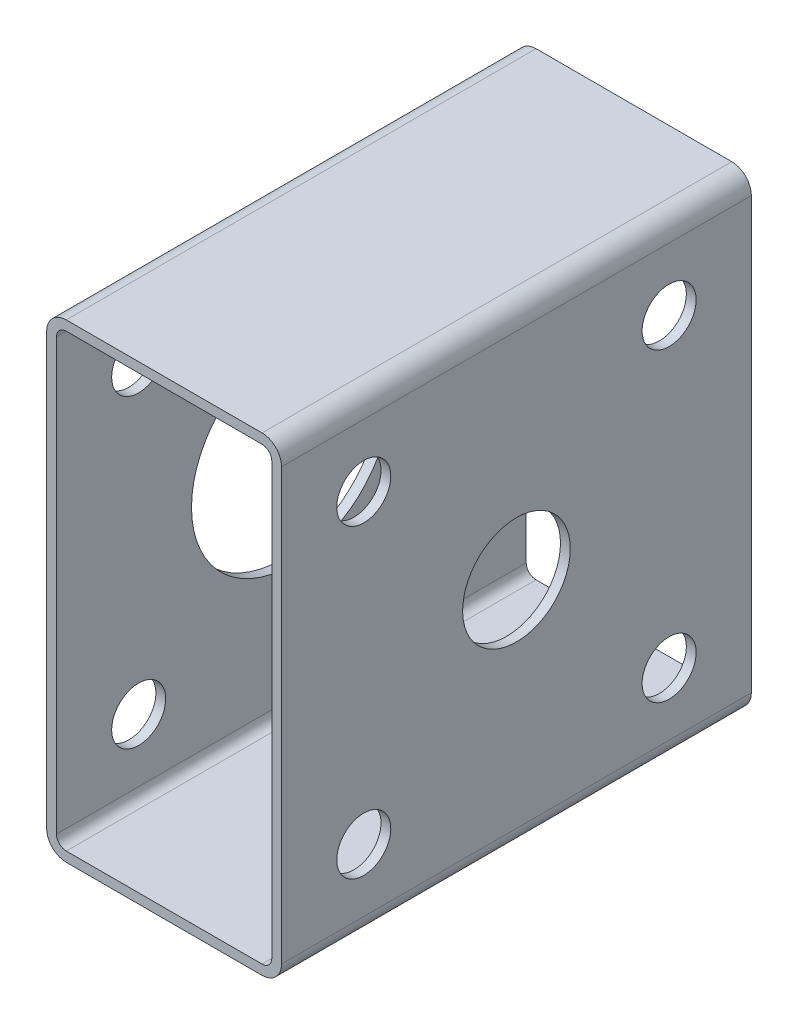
ISO-10303-21;
HEADER;
FILE_DESCRIPTION(('STEP AP214'),'2;1');
FILE_NAME('part.step','',(''),(''),'','','');
FILE_SCHEMA(('AUTOMOTIVE_DESIGN { 1 0 10303 214 1 1 1 1 }'));
ENDSEC;
DATA;
#1=APPLICATION_CONTEXT('core data for automotive mechanical design processes');
#2=APPLICATION_PROTOCOL_DEFINITION('international standard','automotive_design',2000,#1);
#3=PRODUCT_CONTEXT('',#1,'mechanical');
#4=PRODUCT('Part','Part','',(#3));
#5=PRODUCT_RELATED_PRODUCT_CATEGORY('part','',(#4));
#6=PRODUCT_DEFINITION_FORMATION('','',#4);
#7=PRODUCT_DEFINITION_CONTEXT('part definition',#1,'design');
#8=PRODUCT_DEFINITION('design','',#6,#7);
#9=PRODUCT_DEFINITION_SHAPE('','',#8);
#10=(LENGTH_UNIT() NAMED_UNIT(*) SI_UNIT(.MILLI.,.METRE.));
#11=(NAMED_UNIT(*) PLANE_ANGLE_UNIT() SI_UNIT($,.RADIAN.));
#12=(NAMED_UNIT(*) SI_UNIT($,.STERADIAN.) SOLID_ANGLE_UNIT());
#13=UNCERTAINTY_MEASURE_WITH_UNIT(LENGTH_MEASURE(1.E-05),#10,'distance_accuracy_value','');
#14=(GEOMETRIC_REPRESENTATION_CONTEXT(3) GLOBAL_UNCERTAINTY_ASSIGNED_CONTEXT((#13)) GLOBAL_UNIT_ASSIGNED_CONTEXT((#10,
#11,#12)) REPRESENTATION_CONTEXT('',''));
#15=CARTESIAN_POINT('',(0.,0.,0.));
#16=DIRECTION('',(0.,0.,1.));
#17=DIRECTION('',(1.,0.,0.));
#18=AXIS2_PLACEMENT_3D('',#15,#16,#17);
#19=CARTESIAN_POINT('',(-31.75,-69.85,152.4));
#20=DIRECTION('',(0.,0.,1.));
#21=DIRECTION('',(1.,0.,0.));
#22=AXIS2_PLACEMENT_3D('',#19,#20,#21);
#23=PLANE('',#22);
#24=CARTESIAN_POINT('',(-31.75,-69.85,152.4));
#25=DIRECTION('',(0.,0.,1.));
#26=DIRECTION('',(1.,0.,0.));
#27=AXIS2_PLACEMENT_3D('',#24,#25,#26);
#28=CIRCLE('',#27,6.35);
#29=CARTESIAN_POINT('',(-38.1,-69.85,152.4));
#30=VERTEX_POINT('',#29);
#31=CARTESIAN_POINT('',(-31.75,-76.2,152.4));
#32=VERTEX_POINT('',#31);
#33=EDGE_CURVE('E210',#30,#32,#28,.T.);
#34=ORIENTED_EDGE('',*,*,#33,.T.);
#35=DIRECTION('',(1.,0.,0.));
#36=VECTOR('',#35,1.);
#37=CARTESIAN_POINT('',(-31.75,-76.2,152.4));
#38=LINE('',#37,#36);
#39=CARTESIAN_POINT('',(31.75,-76.2,152.4));
#40=VERTEX_POINT('',#39);
#41=EDGE_CURVE('E213',#32,#40,#38,.T.);
#42=ORIENTED_EDGE('',*,*,#41,.T.);
#43=CARTESIAN_POINT('',(31.75,-69.85,152.4));
#44=DIRECTION('',(0.,0.,1.));
#45=DIRECTION('',(-1.,0.,0.));
#46=AXIS2_PLACEMENT_3D('',#43,#44,#45);
#47=CIRCLE('',#46,6.34999999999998);
#48=CARTESIAN_POINT('',(38.1,-69.85,152.4));
#49=VERTEX_POINT('',#48);
#50=EDGE_CURVE('E216',#40,#49,#47,.T.);
#51=ORIENTED_EDGE('',*,*,#50,.T.);
#52=DIRECTION('',(0.,1.,0.));
#53=VECTOR('',#52,1.);
#54=CARTESIAN_POINT('',(38.1,-69.85,152.4));
#55=LINE('',#54,#53);
#56=CARTESIAN_POINT('',(38.1,69.85,152.4));
#57=VERTEX_POINT('',#56);
#58=EDGE_CURVE('E218',#49,#57,#55,.T.);
#59=ORIENTED_EDGE('',*,*,#58,.T.);
#60=CARTESIAN_POINT('',(31.75,69.85,152.4));
#61=DIRECTION('',(0.,0.,1.));
#62=DIRECTION('',(1.,0.,0.));
#63=AXIS2_PLACEMENT_3D('',#60,#61,#62);
#64=CIRCLE('',#63,6.35);
#65=CARTESIAN_POINT('',(31.75,76.2,152.4));
#66=VERTEX_POINT('',#65);
#67=EDGE_CURVE('E220',#57,#66,#64,.T.);
#68=ORIENTED_EDGE('',*,*,#67,.T.);
#69=DIRECTION('',(-1.,0.,0.));
#70=VECTOR('',#69,1.);
#71=CARTESIAN_POINT('',(-31.75,76.2,152.4));
#72=LINE('',#71,#70);
#73=CARTESIAN_POINT('',(-31.75,76.2,152.4));
#74=VERTEX_POINT('',#73);
#75=EDGE_CURVE('E222',#66,#74,#72,.T.);
#76=ORIENTED_EDGE('',*,*,#75,.T.);
#77=CARTESIAN_POINT('',(-31.75,69.85,152.4));
#78=DIRECTION('',(0.,0.,1.));
#79=DIRECTION('',(1.,0.,0.));
#80=AXIS2_PLACEMENT_3D('',#77,#78,#79);
#81=CIRCLE('',#80,6.34999999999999);
#82=CARTESIAN_POINT('',(-38.1,69.85,152.4));
#83=VERTEX_POINT('',#82);
#84=EDGE_CURVE('E224',#74,#83,#81,.T.);
#85=ORIENTED_EDGE('',*,*,#84,.T.);
#86=DIRECTION('',(0.,-1.,0.));
#87=VECTOR('',#86,1.);
#88=CARTESIAN_POINT('',(-38.1,-69.85,152.4));
#89=LINE('',#88,#87);
#90=EDGE_CURVE('E226',#83,#30,#89,.T.);
#91=ORIENTED_EDGE('',*,*,#90,.T.);
#92=EDGE_LOOP('',(#34,#42,#51,#59,#68,#76,#85,#91));
#93=FACE_BOUND('',#92,.T.);
#94=DIRECTION('',(1.,0.,0.));
#95=VECTOR('',#94,1.);
#96=CARTESIAN_POINT('',(-31.75,-73.025,152.4));
#97=LINE('',#96,#95);
#98=CARTESIAN_POINT('',(-31.75,-73.025,152.4));
#99=VERTEX_POINT('',#98);
#100=CARTESIAN_POINT('',(31.75,-73.025,152.4));
#101=VERTEX_POINT('',#100);
#102=EDGE_CURVE('E151',#99,#101,#97,.T.);
#103=ORIENTED_EDGE('',*,*,#102,.F.);
#104=CARTESIAN_POINT('',(-31.75,-69.85,152.4));
#105=DIRECTION('',(0.,0.,1.));
#106=DIRECTION('',(1.,0.,0.));
#107=AXIS2_PLACEMENT_3D('',#104,#105,#106);
#108=CIRCLE('',#107,3.17500000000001);
#109=CARTESIAN_POINT('',(-34.925,-69.85,152.4));
#110=VERTEX_POINT('',#109);
#111=EDGE_CURVE('E143',#110,#99,#108,.T.);
#112=ORIENTED_EDGE('',*,*,#111,.F.);
#113=DIRECTION('',(0.,-1.,0.));
#114=VECTOR('',#113,1.);
#115=CARTESIAN_POINT('',(-34.925,-69.85,152.4));
#116=LINE('',#115,#114);
#117=CARTESIAN_POINT('',(-34.925,69.85,152.4));
#118=VERTEX_POINT('',#117);
#119=EDGE_CURVE('E177',#118,#110,#116,.T.);
#120=ORIENTED_EDGE('',*,*,#119,.F.);
#121=CARTESIAN_POINT('',(-31.75,69.85,152.4));
#122=DIRECTION('',(0.,0.,1.));
#123=DIRECTION('',(1.,0.,0.));
#124=AXIS2_PLACEMENT_3D('',#121,#122,#123);
#125=CIRCLE('',#124,3.175);
#126=CARTESIAN_POINT('',(-31.75,73.025,152.4));
#127=VERTEX_POINT('',#126);
#128=EDGE_CURVE('E175',#127,#118,#125,.T.);
#129=ORIENTED_EDGE('',*,*,#128,.F.);
#130=DIRECTION('',(-1.,0.,0.));
#131=VECTOR('',#130,1.);
#132=CARTESIAN_POINT('',(-31.75,73.025,152.4));
#133=LINE('',#132,#131);
#134=CARTESIAN_POINT('',(31.75,73.025,152.4));
#135=VERTEX_POINT('',#134);
#136=EDGE_CURVE('E173',#135,#127,#133,.T.);
#137=ORIENTED_EDGE('',*,*,#136,.F.);
#138=CARTESIAN_POINT('',(31.75,69.85,152.4));
#139=DIRECTION('',(0.,0.,1.));
#140=DIRECTION('',(1.,0.,0.));
#141=AXIS2_PLACEMENT_3D('',#138,#139,#140);
#142=CIRCLE('',#141,3.17500000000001);
#143=CARTESIAN_POINT('',(34.925,69.85,152.4));
#144=VERTEX_POINT('',#143);
#145=EDGE_CURVE('E171',#144,#135,#142,.T.);
#146=ORIENTED_EDGE('',*,*,#145,.F.);
#147=DIRECTION('',(0.,1.,0.));
#148=VECTOR('',#147,1.);
#149=CARTESIAN_POINT('',(34.925,-69.85,152.4));
#150=LINE('',#149,#148);
#151=CARTESIAN_POINT('',(34.925,-69.85,152.4));
#152=VERTEX_POINT('',#151);
#153=EDGE_CURVE('E166',#152,#144,#150,.T.);
#154=ORIENTED_EDGE('',*,*,#153,.F.);
#155=CARTESIAN_POINT('',(31.75,-69.85,152.4));
#156=DIRECTION('',(0.,0.,1.));
#157=DIRECTION('',(-1.,0.,0.));
#158=AXIS2_PLACEMENT_3D('',#155,#156,#157);
#159=CIRCLE('',#158,3.17499999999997);
#160=EDGE_CURVE('E164',#101,#152,#159,.T.);
#161=ORIENTED_EDGE('',*,*,#160,.F.);
#162=EDGE_LOOP('',(#103,#112,#120,#129,#137,#146,#154,#161));
#163=FACE_BOUND('',#162,.T.);
#164=ADVANCED_FACE('F30',(#93,#163),#23,.T.);
#165=CARTESIAN_POINT('',(-31.75,-69.85,0.));
#166=DIRECTION('',(0.,0.,1.));
#167=DIRECTION('',(1.,0.,0.));
#168=AXIS2_PLACEMENT_3D('',#165,#166,#167);
#169=PLANE('',#168);
#170=CARTESIAN_POINT('',(-31.75,-69.85,0.));
#171=DIRECTION('',(0.,0.,1.));
#172=DIRECTION('',(1.,0.,0.));
#173=AXIS2_PLACEMENT_3D('',#170,#171,#172);
#174=CIRCLE('',#173,6.35);
#175=CARTESIAN_POINT('',(-38.1,-69.85,0.));
#176=VERTEX_POINT('',#175);
#177=CARTESIAN_POINT('',(-31.75,-76.2,0.));
#178=VERTEX_POINT('',#177);
#179=EDGE_CURVE('E159',#176,#178,#174,.T.);
#180=ORIENTED_EDGE('',*,*,#179,.F.);
#181=DIRECTION('',(0.,-1.,0.));
#182=VECTOR('',#181,1.);
#183=CARTESIAN_POINT('',(-38.1,-69.85,0.));
#184=LINE('',#183,#182);
#185=CARTESIAN_POINT('',(-38.1,69.85,0.));
#186=VERTEX_POINT('',#185);
#187=EDGE_CURVE('E214',#186,#176,#184,.T.);
#188=ORIENTED_EDGE('',*,*,#187,.F.);
#189=CARTESIAN_POINT('',(-31.75,69.85,0.));
#190=DIRECTION('',(0.,0.,1.));
#191=DIRECTION('',(1.,0.,0.));
#192=AXIS2_PLACEMENT_3D('',#189,#190,#191);
#193=CIRCLE('',#192,6.34999999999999);
#194=CARTESIAN_POINT('',(-31.75,76.2,0.));
#195=VERTEX_POINT('',#194);
#196=EDGE_CURVE('E241',#195,#186,#193,.T.);
#197=ORIENTED_EDGE('',*,*,#196,.F.);
#198=DIRECTION('',(-1.,0.,0.));
#199=VECTOR('',#198,1.);
#200=CARTESIAN_POINT('',(-31.75,76.2,0.));
#201=LINE('',#200,#199);
#202=CARTESIAN_POINT('',(31.75,76.2,0.));
#203=VERTEX_POINT('',#202);
#204=EDGE_CURVE('E239',#203,#195,#201,.T.);
#205=ORIENTED_EDGE('',*,*,#204,.F.);
#206=CARTESIAN_POINT('',(31.75,69.85,0.));
#207=DIRECTION('',(0.,0.,1.));
#208=DIRECTION('',(1.,0.,0.));
#209=AXIS2_PLACEMENT_3D('',#206,#207,#208);
#210=CIRCLE('',#209,6.35);
#211=CARTESIAN_POINT('',(38.1,69.85,0.));
#212=VERTEX_POINT('',#211);
#213=EDGE_CURVE('E237',#212,#203,#210,.T.);
#214=ORIENTED_EDGE('',*,*,#213,.F.);
#215=DIRECTION('',(0.,1.,0.));
#216=VECTOR('',#215,1.);
#217=CARTESIAN_POINT('',(38.1,-69.85,0.));
#218=LINE('',#217,#216);
#219=CARTESIAN_POINT('',(38.1,-69.85,0.));
#220=VERTEX_POINT('',#219);
#221=EDGE_CURVE('E235',#220,#212,#218,.T.);
#222=ORIENTED_EDGE('',*,*,#221,.F.);
#223=CARTESIAN_POINT('',(31.75,-69.85,0.));
#224=DIRECTION('',(0.,0.,1.));
#225=DIRECTION('',(-1.,0.,0.));
#226=AXIS2_PLACEMENT_3D('',#223,#224,#225);
#227=CIRCLE('',#226,6.34999999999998);
#228=CARTESIAN_POINT('',(31.75,-76.2,0.));
#229=VERTEX_POINT('',#228);
#230=EDGE_CURVE('E233',#229,#220,#227,.T.);
#231=ORIENTED_EDGE('',*,*,#230,.F.);
#232=DIRECTION('',(1.,0.,0.));
#233=VECTOR('',#232,1.);
#234=CARTESIAN_POINT('',(-31.75,-76.2,0.));
#235=LINE('',#234,#233);
#236=EDGE_CURVE('E231',#178,#229,#235,.T.);
#237=ORIENTED_EDGE('',*,*,#236,.F.);
#238=EDGE_LOOP('',(#180,#188,#197,#205,#214,#222,#231,#237));
#239=FACE_BOUND('',#238,.T.);
#240=CARTESIAN_POINT('',(-31.75,-69.85,0.));
#241=DIRECTION('',(0.,0.,1.));
#242=DIRECTION('',(1.,0.,0.));
#243=AXIS2_PLACEMENT_3D('',#240,#241,#242);
#244=CIRCLE('',#243,3.17500000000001);
#245=CARTESIAN_POINT('',(-34.925,-69.85,0.));
#246=VERTEX_POINT('',#245);
#247=CARTESIAN_POINT('',(-31.75,-73.025,0.));
#248=VERTEX_POINT('',#247);
#249=EDGE_CURVE('E53',#246,#248,#244,.T.);
#250=ORIENTED_EDGE('',*,*,#249,.T.);
#251=DIRECTION('',(1.,0.,0.));
#252=VECTOR('',#251,1.);
#253=CARTESIAN_POINT('',(-31.75,-73.025,0.));
#254=LINE('',#253,#252);
#255=CARTESIAN_POINT('',(31.75,-73.025,0.));
#256=VERTEX_POINT('',#255);
#257=EDGE_CURVE('E158',#248,#256,#254,.T.);
#258=ORIENTED_EDGE('',*,*,#257,.T.);
#259=CARTESIAN_POINT('',(31.75,-69.85,0.));
#260=DIRECTION('',(0.,0.,1.));
#261=DIRECTION('',(-1.,0.,0.));
#262=AXIS2_PLACEMENT_3D('',#259,#260,#261);
#263=CIRCLE('',#262,3.17499999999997);
#264=CARTESIAN_POINT('',(34.925,-69.85,0.));
#265=VERTEX_POINT('',#264);
#266=EDGE_CURVE('E182',#256,#265,#263,.T.);
#267=ORIENTED_EDGE('',*,*,#266,.T.);
#268=DIRECTION('',(0.,1.,0.));
#269=VECTOR('',#268,1.);
#270=CARTESIAN_POINT('',(34.925,-69.85,0.));
#271=LINE('',#270,#269);
#272=CARTESIAN_POINT('',(34.925,69.85,0.));
#273=VERTEX_POINT('',#272);
#274=EDGE_CURVE('E185',#265,#273,#271,.T.);
#275=ORIENTED_EDGE('',*,*,#274,.T.);
#276=CARTESIAN_POINT('',(31.75,69.85,0.));
#277=DIRECTION('',(0.,0.,1.));
#278=DIRECTION('',(1.,0.,0.));
#279=AXIS2_PLACEMENT_3D('',#276,#277,#278);
#280=CIRCLE('',#279,3.17500000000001);
#281=CARTESIAN_POINT('',(31.75,73.025,0.));
#282=VERTEX_POINT('',#281);
#283=EDGE_CURVE('E188',#273,#282,#280,.T.);
#284=ORIENTED_EDGE('',*,*,#283,.T.);
#285=DIRECTION('',(-1.,0.,0.));
#286=VECTOR('',#285,1.);
#287=CARTESIAN_POINT('',(-31.75,73.025,0.));
#288=LINE('',#287,#286);
#289=CARTESIAN_POINT('',(-31.75,73.025,0.));
#290=VERTEX_POINT('',#289);
#291=EDGE_CURVE('E191',#282,#290,#288,.T.);
#292=ORIENTED_EDGE('',*,*,#291,.T.);
#293=CARTESIAN_POINT('',(-31.75,69.85,0.));
#294=DIRECTION('',(0.,0.,1.));
#295=DIRECTION('',(1.,0.,0.));
#296=AXIS2_PLACEMENT_3D('',#293,#294,#295);
#297=CIRCLE('',#296,3.175);
#298=CARTESIAN_POINT('',(-34.925,69.85,0.));
#299=VERTEX_POINT('',#298);
#300=EDGE_CURVE('E194',#290,#299,#297,.T.);
#301=ORIENTED_EDGE('',*,*,#300,.T.);
#302=DIRECTION('',(0.,-1.,0.));
#303=VECTOR('',#302,1.);
#304=CARTESIAN_POINT('',(-34.925,-69.85,0.));
#305=LINE('',#304,#303);
#306=EDGE_CURVE('E152',#299,#246,#305,.T.);
#307=ORIENTED_EDGE('',*,*,#306,.T.);
#308=EDGE_LOOP('',(#250,#258,#267,#275,#284,#292,#301,#307));
#309=FACE_BOUND('',#308,.T.);
#310=ADVANCED_FACE('F271',(#239,#309),#169,.F.);
#311=CARTESIAN_POINT('',(-31.75,-69.85,152.4));
#312=DIRECTION('',(0.,0.,-1.));
#313=DIRECTION('',(-1.,0.,0.));
#314=AXIS2_PLACEMENT_3D('',#311,#312,#313);
#315=CYLINDRICAL_SURFACE('',#314,6.35);
#316=ORIENTED_EDGE('',*,*,#179,.T.);
#317=DIRECTION('',(0.,0.,-1.));
#318=VECTOR('',#317,1.);
#319=CARTESIAN_POINT('',(-31.75,-76.2,152.4));
#320=LINE('',#319,#318);
#321=EDGE_CURVE('E11',#32,#178,#320,.T.);
#322=ORIENTED_EDGE('',*,*,#321,.F.);
#323=ORIENTED_EDGE('',*,*,#33,.F.);
#324=DIRECTION('',(0.,0.,-1.));
#325=VECTOR('',#324,1.);
#326=CARTESIAN_POINT('',(-38.1,-69.85,152.4));
#327=LINE('',#326,#325);
#328=EDGE_CURVE('E228',#30,#176,#327,.T.);
#329=ORIENTED_EDGE('',*,*,#328,.T.);
#330=EDGE_LOOP('',(#316,#322,#323,#329));
#331=FACE_BOUND('',#330,.T.);
#332=ADVANCED_FACE('F32',(#331),#315,.T.);
#333=CARTESIAN_POINT('',(-31.75,-76.2,152.4));
#334=DIRECTION('',(0.,1.,0.));
#335=DIRECTION('',(0.,0.,1.));
#336=AXIS2_PLACEMENT_3D('',#333,#334,#335);
#337=PLANE('',#336);
#338=ORIENTED_EDGE('',*,*,#236,.T.);
#339=DIRECTION('',(0.,0.,-1.));
#340=VECTOR('',#339,1.);
#341=CARTESIAN_POINT('',(31.75,-76.2,152.4));
#342=LINE('',#341,#340);
#343=EDGE_CURVE('E38',#40,#229,#342,.T.);
#344=ORIENTED_EDGE('',*,*,#343,.F.);
#345=ORIENTED_EDGE('',*,*,#41,.F.);
#346=ORIENTED_EDGE('',*,*,#321,.T.);
#347=EDGE_LOOP('',(#338,#344,#345,#346));
#348=FACE_BOUND('',#347,.T.);
#349=ADVANCED_FACE('F288',(#348),#337,.F.);
#350=CARTESIAN_POINT('',(31.75,-69.85,152.4));
#351=DIRECTION('',(0.,0.,-1.));
#352=DIRECTION('',(-1.,0.,0.));
#353=AXIS2_PLACEMENT_3D('',#350,#351,#352);
#354=CYLINDRICAL_SURFACE('',#353,6.34999999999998);
#355=ORIENTED_EDGE('',*,*,#230,.T.);
#356=DIRECTION('',(0.,0.,-1.));
#357=VECTOR('',#356,1.);
#358=CARTESIAN_POINT('',(38.1,-69.85,152.4));
#359=LINE('',#358,#357);
#360=EDGE_CURVE('E258',#49,#220,#359,.T.);
#361=ORIENTED_EDGE('',*,*,#360,.F.);
#362=ORIENTED_EDGE('',*,*,#50,.F.);
#363=ORIENTED_EDGE('',*,*,#343,.T.);
#364=EDGE_LOOP('',(#355,#361,#362,#363));
#365=FACE_BOUND('',#364,.T.);
#366=ADVANCED_FACE('F265',(#365),#354,.T.);
#367=CARTESIAN_POINT('',(38.1,-69.85,152.4));
#368=DIRECTION('',(-1.,0.,0.));
#369=DIRECTION('',(0.,-1.,0.));
#370=AXIS2_PLACEMENT_3D('',#367,#368,#369);
#371=PLANE('',#370);
#372=CARTESIAN_POINT('',(38.1,-49.53,26.67));
#373=DIRECTION('',(1.,0.,0.));
#374=DIRECTION('',(0.,1.,0.));
#375=AXIS2_PLACEMENT_3D('',#372,#373,#374);
#376=CIRCLE('',#375,8.76299999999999);
#377=CARTESIAN_POINT('',(38.1,-40.767,26.67));
#378=VERTEX_POINT('',#377);
#379=EDGE_CURVE('E348',#378,#378,#376,.T.);
#380=ORIENTED_EDGE('',*,*,#379,.F.);
#381=EDGE_LOOP('',(#380));
#382=FACE_BOUND('',#381,.T.);
#383=CARTESIAN_POINT('',(38.1,-49.53,125.73));
#384=DIRECTION('',(1.,0.,0.));
#385=DIRECTION('',(0.,1.,0.));
#386=AXIS2_PLACEMENT_3D('',#383,#384,#385);
#387=CIRCLE('',#386,8.76299999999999);
#388=CARTESIAN_POINT('',(38.1,-40.767,125.73));
#389=VERTEX_POINT('',#388);
#390=EDGE_CURVE('E361',#389,#389,#387,.T.);
#391=ORIENTED_EDGE('',*,*,#390,.F.);
#392=EDGE_LOOP('',(#391));
#393=FACE_BOUND('',#392,.T.);
#394=CARTESIAN_POINT('',(38.1,49.53,26.67));
#395=DIRECTION('',(1.,0.,0.));
#396=DIRECTION('',(0.,1.,0.));
#397=AXIS2_PLACEMENT_3D('',#394,#395,#396);
#398=CIRCLE('',#397,8.76299999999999);
#399=CARTESIAN_POINT('',(38.1,58.293,26.67));
#400=VERTEX_POINT('',#399);
#401=EDGE_CURVE('E367',#400,#400,#398,.T.);
#402=ORIENTED_EDGE('',*,*,#401,.F.);
#403=EDGE_LOOP('',(#402));
#404=FACE_BOUND('',#403,.T.);
#405=CARTESIAN_POINT('',(38.1,49.53,125.73));
#406=DIRECTION('',(1.,0.,0.));
#407=DIRECTION('',(0.,1.,0.));
#408=AXIS2_PLACEMENT_3D('',#405,#406,#407);
#409=CIRCLE('',#408,8.76299999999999);
#410=CARTESIAN_POINT('',(38.1,58.293,125.73));
#411=VERTEX_POINT('',#410);
#412=EDGE_CURVE('E373',#411,#411,#409,.T.);
#413=ORIENTED_EDGE('',*,*,#412,.F.);
#414=EDGE_LOOP('',(#413));
#415=FACE_BOUND('',#414,.T.);
#416=CARTESIAN_POINT('',(38.1,0.,76.2));
#417=DIRECTION('',(1.,0.,0.));
#418=DIRECTION('',(0.,1.,0.));
#419=AXIS2_PLACEMENT_3D('',#416,#417,#418);
#420=CIRCLE('',#419,17.4625);
#421=CARTESIAN_POINT('',(38.1,17.4625,76.2));
#422=VERTEX_POINT('',#421);
#423=EDGE_CURVE('E180',#422,#422,#420,.T.);
#424=ORIENTED_EDGE('',*,*,#423,.F.);
#425=EDGE_LOOP('',(#424));
#426=FACE_BOUND('',#425,.T.);
#427=ORIENTED_EDGE('',*,*,#221,.T.);
#428=DIRECTION('',(0.,0.,-1.));
#429=VECTOR('',#428,1.);
#430=CARTESIAN_POINT('',(38.1,69.85,152.4));
#431=LINE('',#430,#429);
#432=EDGE_CURVE('E255',#57,#212,#431,.T.);
#433=ORIENTED_EDGE('',*,*,#432,.F.);
#434=ORIENTED_EDGE('',*,*,#58,.F.);
#435=ORIENTED_EDGE('',*,*,#360,.T.);
#436=EDGE_LOOP('',(#427,#433,#434,#435));
#437=FACE_BOUND('',#436,.T.);
#438=ADVANCED_FACE('F277',(#382,#393,#404,#415,#426,#437),#371,.F.);
#439=CARTESIAN_POINT('',(31.75,69.85,152.4));
#440=DIRECTION('',(0.,0.,-1.));
#441=DIRECTION('',(-1.,0.,0.));
#442=AXIS2_PLACEMENT_3D('',#439,#440,#441);
#443=CYLINDRICAL_SURFACE('',#442,6.35);
#444=ORIENTED_EDGE('',*,*,#213,.T.);
#445=DIRECTION('',(0.,0.,-1.));
#446=VECTOR('',#445,1.);
#447=CARTESIAN_POINT('',(31.75,76.2,152.4));
#448=LINE('',#447,#446);
#449=EDGE_CURVE('E252',#66,#203,#448,.T.);
#450=ORIENTED_EDGE('',*,*,#449,.F.);
#451=ORIENTED_EDGE('',*,*,#67,.F.);
#452=ORIENTED_EDGE('',*,*,#432,.T.);
#453=EDGE_LOOP('',(#444,#450,#451,#452));
#454=FACE_BOUND('',#453,.T.);
#455=ADVANCED_FACE('F281',(#454),#443,.T.);
#456=CARTESIAN_POINT('',(-31.75,76.2,152.4));
#457=DIRECTION('',(0.,-1.,0.));
#458=DIRECTION('',(0.,0.,-1.));
#459=AXIS2_PLACEMENT_3D('',#456,#457,#458);
#460=PLANE('',#459);
#461=ORIENTED_EDGE('',*,*,#204,.T.);
#462=DIRECTION('',(0.,0.,-1.));
#463=VECTOR('',#462,1.);
#464=CARTESIAN_POINT('',(-31.75,76.2,152.4));
#465=LINE('',#464,#463);
#466=EDGE_CURVE('E249',#74,#195,#465,.T.);
#467=ORIENTED_EDGE('',*,*,#466,.F.);
#468=ORIENTED_EDGE('',*,*,#75,.F.);
#469=ORIENTED_EDGE('',*,*,#449,.T.);
#470=EDGE_LOOP('',(#461,#467,#468,#469));
#471=FACE_BOUND('',#470,.T.);
#472=ADVANCED_FACE('F301',(#471),#460,.F.);
#473=CARTESIAN_POINT('',(-31.75,69.85,152.4));
#474=DIRECTION('',(0.,0.,-1.));
#475=DIRECTION('',(-1.,0.,0.));
#476=AXIS2_PLACEMENT_3D('',#473,#474,#475);
#477=CYLINDRICAL_SURFACE('',#476,6.34999999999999);
#478=ORIENTED_EDGE('',*,*,#196,.T.);
#479=DIRECTION('',(0.,0.,-1.));
#480=VECTOR('',#479,1.);
#481=CARTESIAN_POINT('',(-38.1,69.85,152.4));
#482=LINE('',#481,#480);
#483=EDGE_CURVE('E246',#83,#186,#482,.T.);
#484=ORIENTED_EDGE('',*,*,#483,.F.);
#485=ORIENTED_EDGE('',*,*,#84,.F.);
#486=ORIENTED_EDGE('',*,*,#466,.T.);
#487=EDGE_LOOP('',(#478,#484,#485,#486));
#488=FACE_BOUND('',#487,.T.);
#489=ADVANCED_FACE('F299',(#488),#477,.T.);
#490=CARTESIAN_POINT('',(-38.1,-69.85,152.4));
#491=DIRECTION('',(1.,0.,0.));
#492=DIRECTION('',(0.,1.,0.));
#493=AXIS2_PLACEMENT_3D('',#490,#491,#492);
#494=PLANE('',#493);
#495=CARTESIAN_POINT('',(-38.1,-49.53,125.73));
#496=DIRECTION('',(-1.,0.,0.));
#497=DIRECTION('',(0.,-1.,0.));
#498=AXIS2_PLACEMENT_3D('',#495,#496,#497);
#499=CIRCLE('',#498,8.76299999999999);
#500=CARTESIAN_POINT('',(-38.1,-58.2929999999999,125.73));
#501=VERTEX_POINT('',#500);
#502=EDGE_CURVE('E327',#501,#501,#499,.T.);
#503=ORIENTED_EDGE('',*,*,#502,.F.);
#504=EDGE_LOOP('',(#503));
#505=FACE_BOUND('',#504,.T.);
#506=CARTESIAN_POINT('',(-38.1,-49.53,26.67));
#507=DIRECTION('',(-1.,0.,0.));
#508=DIRECTION('',(0.,-1.,0.));
#509=AXIS2_PLACEMENT_3D('',#506,#507,#508);
#510=CIRCLE('',#509,8.76299999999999);
#511=CARTESIAN_POINT('',(-38.1,-58.2929999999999,26.67));
#512=VERTEX_POINT('',#511);
#513=EDGE_CURVE('E331',#512,#512,#510,.T.);
#514=ORIENTED_EDGE('',*,*,#513,.F.);
#515=EDGE_LOOP('',(#514));
#516=FACE_BOUND('',#515,.T.);
#517=CARTESIAN_POINT('',(-38.1,49.53,125.73));
#518=DIRECTION('',(-1.,0.,0.));
#519=DIRECTION('',(0.,-1.,0.));
#520=AXIS2_PLACEMENT_3D('',#517,#518,#519);
#521=CIRCLE('',#520,8.76299999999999);
#522=CARTESIAN_POINT('',(-38.1,40.7670000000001,125.73));
#523=VERTEX_POINT('',#522);
#524=EDGE_CURVE('E335',#523,#523,#521,.T.);
#525=ORIENTED_EDGE('',*,*,#524,.F.);
#526=EDGE_LOOP('',(#525));
#527=FACE_BOUND('',#526,.T.);
#528=CARTESIAN_POINT('',(-38.1,49.53,26.67));
#529=DIRECTION('',(-1.,0.,0.));
#530=DIRECTION('',(0.,-1.,0.));
#531=AXIS2_PLACEMENT_3D('',#528,#529,#530);
#532=CIRCLE('',#531,8.76299999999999);
#533=CARTESIAN_POINT('',(-38.1,40.7670000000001,26.67));
#534=VERTEX_POINT('',#533);
#535=EDGE_CURVE('E339',#534,#534,#532,.T.);
#536=ORIENTED_EDGE('',*,*,#535,.F.);
#537=EDGE_LOOP('',(#536));
#538=FACE_BOUND('',#537,.T.);
#539=CARTESIAN_POINT('',(-38.1,0.,76.2));
#540=DIRECTION('',(-1.,0.,0.));
#541=DIRECTION('',(0.,-1.,0.));
#542=AXIS2_PLACEMENT_3D('',#539,#540,#541);
#543=CIRCLE('',#542,32.385);
#544=CARTESIAN_POINT('',(-38.1,-32.385,76.2));
#545=VERTEX_POINT('',#544);
#546=EDGE_CURVE('E342',#545,#545,#543,.T.);
#547=ORIENTED_EDGE('',*,*,#546,.F.);
#548=EDGE_LOOP('',(#547));
#549=FACE_BOUND('',#548,.T.);
#550=ORIENTED_EDGE('',*,*,#187,.T.);
#551=ORIENTED_EDGE('',*,*,#328,.F.);
#552=ORIENTED_EDGE('',*,*,#90,.F.);
#553=ORIENTED_EDGE('',*,*,#483,.T.);
#554=EDGE_LOOP('',(#550,#551,#552,#553));
#555=FACE_BOUND('',#554,.T.);
#556=ADVANCED_FACE('F294',(#505,#516,#527,#538,#549,#555),#494,.F.);
#557=CARTESIAN_POINT('',(-31.75,-69.85,152.4));
#558=DIRECTION('',(0.,0.,-1.));
#559=DIRECTION('',(-1.,0.,0.));
#560=AXIS2_PLACEMENT_3D('',#557,#558,#559);
#561=CYLINDRICAL_SURFACE('',#560,3.17500000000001);
#562=ORIENTED_EDGE('',*,*,#249,.F.);
#563=DIRECTION('',(0.,0.,-1.));
#564=VECTOR('',#563,1.);
#565=CARTESIAN_POINT('',(-34.925,-69.85,152.4));
#566=LINE('',#565,#564);
#567=EDGE_CURVE('E147',#110,#246,#566,.T.);
#568=ORIENTED_EDGE('',*,*,#567,.F.);
#569=ORIENTED_EDGE('',*,*,#111,.T.);
#570=DIRECTION('',(0.,0.,-1.));
#571=VECTOR('',#570,1.);
#572=CARTESIAN_POINT('',(-31.75,-73.025,152.4));
#573=LINE('',#572,#571);
#574=EDGE_CURVE('E146',#99,#248,#573,.T.);
#575=ORIENTED_EDGE('',*,*,#574,.T.);
#576=EDGE_LOOP('',(#562,#568,#569,#575));
#577=FACE_BOUND('',#576,.T.);
#578=ADVANCED_FACE('F145',(#577),#561,.F.);
#579=CARTESIAN_POINT('',(-31.75,-73.025,152.4));
#580=DIRECTION('',(0.,1.,0.));
#581=DIRECTION('',(-1.,0.,0.));
#582=AXIS2_PLACEMENT_3D('',#579,#580,#581);
#583=PLANE('',#582);
#584=ORIENTED_EDGE('',*,*,#257,.F.);
#585=ORIENTED_EDGE('',*,*,#574,.F.);
#586=ORIENTED_EDGE('',*,*,#102,.T.);
#587=DIRECTION('',(0.,0.,-1.));
#588=VECTOR('',#587,1.);
#589=CARTESIAN_POINT('',(31.75,-73.025,152.4));
#590=LINE('',#589,#588);
#591=EDGE_CURVE('E160',#101,#256,#590,.T.);
#592=ORIENTED_EDGE('',*,*,#591,.T.);
#593=EDGE_LOOP('',(#584,#585,#586,#592));
#594=FACE_BOUND('',#593,.T.);
#595=ADVANCED_FACE('F155',(#594),#583,.T.);
#596=CARTESIAN_POINT('',(31.75,-69.85,152.4));
#597=DIRECTION('',(0.,0.,-1.));
#598=DIRECTION('',(-1.,0.,0.));
#599=AXIS2_PLACEMENT_3D('',#596,#597,#598);
#600=CYLINDRICAL_SURFACE('',#599,3.17499999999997);
#601=ORIENTED_EDGE('',*,*,#266,.F.);
#602=ORIENTED_EDGE('',*,*,#591,.F.);
#603=ORIENTED_EDGE('',*,*,#160,.T.);
#604=DIRECTION('',(0.,0.,-1.));
#605=VECTOR('',#604,1.);
#606=CARTESIAN_POINT('',(34.925,-69.85,152.4));
#607=LINE('',#606,#605);
#608=EDGE_CURVE('E207',#152,#265,#607,.T.);
#609=ORIENTED_EDGE('',*,*,#608,.T.);
#610=EDGE_LOOP('',(#601,#602,#603,#609));
#611=FACE_BOUND('',#610,.T.);
#612=ADVANCED_FACE('F458',(#611),#600,.F.);
#613=CARTESIAN_POINT('',(34.925,-69.85,152.4));
#614=DIRECTION('',(-1.,0.,0.));
#615=DIRECTION('',(0.,-1.,0.));
#616=AXIS2_PLACEMENT_3D('',#613,#614,#615);
#617=PLANE('',#616);
#618=CARTESIAN_POINT('',(34.925,-49.53,26.67));
#619=DIRECTION('',(-1.,0.,0.));
#620=DIRECTION('',(0.,-1.,0.));
#621=AXIS2_PLACEMENT_3D('',#618,#619,#620);
#622=CIRCLE('',#621,8.76299999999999);
#623=CARTESIAN_POINT('',(34.925,-58.293,26.67));
#624=VERTEX_POINT('',#623);
#625=EDGE_CURVE('E344',#624,#624,#622,.F.);
#626=ORIENTED_EDGE('',*,*,#625,.T.);
#627=EDGE_LOOP('',(#626));
#628=FACE_BOUND('',#627,.T.);
#629=CARTESIAN_POINT('',(34.925,-49.53,125.73));
#630=DIRECTION('',(-1.,0.,0.));
#631=DIRECTION('',(0.,-1.,0.));
#632=AXIS2_PLACEMENT_3D('',#629,#630,#631);
#633=CIRCLE('',#632,8.76299999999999);
#634=CARTESIAN_POINT('',(34.925,-58.293,125.73));
#635=VERTEX_POINT('',#634);
#636=EDGE_CURVE('E358',#635,#635,#633,.F.);
#637=ORIENTED_EDGE('',*,*,#636,.T.);
#638=EDGE_LOOP('',(#637));
#639=FACE_BOUND('',#638,.T.);
#640=CARTESIAN_POINT('',(34.925,49.53,26.67));
#641=DIRECTION('',(-1.,0.,0.));
#642=DIRECTION('',(0.,-1.,0.));
#643=AXIS2_PLACEMENT_3D('',#640,#641,#642);
#644=CIRCLE('',#643,8.76299999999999);
#645=CARTESIAN_POINT('',(34.925,40.767,26.67));
#646=VERTEX_POINT('',#645);
#647=EDGE_CURVE('E364',#646,#646,#644,.F.);
#648=ORIENTED_EDGE('',*,*,#647,.T.);
#649=EDGE_LOOP('',(#648));
#650=FACE_BOUND('',#649,.T.);
#651=CARTESIAN_POINT('',(34.925,49.53,125.73));
#652=DIRECTION('',(-1.,0.,0.));
#653=DIRECTION('',(0.,-1.,0.));
#654=AXIS2_PLACEMENT_3D('',#651,#652,#653);
#655=CIRCLE('',#654,8.76299999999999);
#656=CARTESIAN_POINT('',(34.925,40.767,125.73));
#657=VERTEX_POINT('',#656);
#658=EDGE_CURVE('E370',#657,#657,#655,.F.);
#659=ORIENTED_EDGE('',*,*,#658,.T.);
#660=EDGE_LOOP('',(#659));
#661=FACE_BOUND('',#660,.T.);
#662=CARTESIAN_POINT('',(34.925,0.,76.2));
#663=DIRECTION('',(-1.,0.,0.));
#664=DIRECTION('',(0.,-1.,0.));
#665=AXIS2_PLACEMENT_3D('',#662,#663,#664);
#666=CIRCLE('',#665,17.4625);
#667=CARTESIAN_POINT('',(34.925,-17.4625,76.2));
#668=VERTEX_POINT('',#667);
#669=EDGE_CURVE('E376',#668,#668,#666,.F.);
#670=ORIENTED_EDGE('',*,*,#669,.T.);
#671=EDGE_LOOP('',(#670));
#672=FACE_BOUND('',#671,.T.);
#673=ORIENTED_EDGE('',*,*,#274,.F.);
#674=ORIENTED_EDGE('',*,*,#608,.F.);
#675=ORIENTED_EDGE('',*,*,#153,.T.);
#676=DIRECTION('',(0.,0.,-1.));
#677=VECTOR('',#676,1.);
#678=CARTESIAN_POINT('',(34.925,69.85,152.4));
#679=LINE('',#678,#677);
#680=EDGE_CURVE('E205',#144,#273,#679,.T.);
#681=ORIENTED_EDGE('',*,*,#680,.T.);
#682=EDGE_LOOP('',(#673,#674,#675,#681));
#683=FACE_BOUND('',#682,.T.);
#684=ADVANCED_FACE('F465',(#628,#639,#650,#661,#672,#683),#617,.T.);
#685=CARTESIAN_POINT('',(31.75,69.85,152.4));
#686=DIRECTION('',(0.,0.,-1.));
#687=DIRECTION('',(-1.,0.,0.));
#688=AXIS2_PLACEMENT_3D('',#685,#686,#687);
#689=CYLINDRICAL_SURFACE('',#688,3.17500000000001);
#690=ORIENTED_EDGE('',*,*,#283,.F.);
#691=ORIENTED_EDGE('',*,*,#680,.F.);
#692=ORIENTED_EDGE('',*,*,#145,.T.);
#693=DIRECTION('',(0.,0.,-1.));
#694=VECTOR('',#693,1.);
#695=CARTESIAN_POINT('',(31.75,73.025,152.4));
#696=LINE('',#695,#694);
#697=EDGE_CURVE('E203',#135,#282,#696,.T.);
#698=ORIENTED_EDGE('',*,*,#697,.T.);
#699=EDGE_LOOP('',(#690,#691,#692,#698));
#700=FACE_BOUND('',#699,.T.);
#701=ADVANCED_FACE('F474',(#700),#689,.F.);
#702=CARTESIAN_POINT('',(-31.75,73.025,152.4));
#703=DIRECTION('',(0.,-1.,0.));
#704=DIRECTION('',(0.,0.,-1.));
#705=AXIS2_PLACEMENT_3D('',#702,#703,#704);
#706=PLANE('',#705);
#707=ORIENTED_EDGE('',*,*,#291,.F.);
#708=ORIENTED_EDGE('',*,*,#697,.F.);
#709=ORIENTED_EDGE('',*,*,#136,.T.);
#710=DIRECTION('',(0.,0.,-1.));
#711=VECTOR('',#710,1.);
#712=CARTESIAN_POINT('',(-31.75,73.025,152.4));
#713=LINE('',#712,#711);
#714=EDGE_CURVE('E201',#127,#290,#713,.T.);
#715=ORIENTED_EDGE('',*,*,#714,.T.);
#716=EDGE_LOOP('',(#707,#708,#709,#715));
#717=FACE_BOUND('',#716,.T.);
#718=ADVANCED_FACE('F483',(#717),#706,.T.);
#719=CARTESIAN_POINT('',(-31.75,69.85,152.4));
#720=DIRECTION('',(0.,0.,-1.));
#721=DIRECTION('',(-1.,0.,0.));
#722=AXIS2_PLACEMENT_3D('',#719,#720,#721);
#723=CYLINDRICAL_SURFACE('',#722,3.175);
#724=ORIENTED_EDGE('',*,*,#300,.F.);
#725=ORIENTED_EDGE('',*,*,#714,.F.);
#726=ORIENTED_EDGE('',*,*,#128,.T.);
#727=DIRECTION('',(0.,0.,-1.));
#728=VECTOR('',#727,1.);
#729=CARTESIAN_POINT('',(-34.925,69.85,152.4));
#730=LINE('',#729,#728);
#731=EDGE_CURVE('E45',#118,#299,#730,.T.);
#732=ORIENTED_EDGE('',*,*,#731,.T.);
#733=EDGE_LOOP('',(#724,#725,#726,#732));
#734=FACE_BOUND('',#733,.T.);
#735=ADVANCED_FACE('F492',(#734),#723,.F.);
#736=CARTESIAN_POINT('',(-34.925,-69.85,152.4));
#737=DIRECTION('',(1.,0.,0.));
#738=DIRECTION('',(0.,1.,0.));
#739=AXIS2_PLACEMENT_3D('',#736,#737,#738);
#740=PLANE('',#739);
#741=CARTESIAN_POINT('',(-34.925,-49.53,125.73));
#742=DIRECTION('',(1.,0.,0.));
#743=DIRECTION('',(0.,1.,0.));
#744=AXIS2_PLACEMENT_3D('',#741,#742,#743);
#745=CIRCLE('',#744,8.76299999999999);
#746=CARTESIAN_POINT('',(-34.925,-40.767,125.73));
#747=VERTEX_POINT('',#746);
#748=EDGE_CURVE('E618',#747,#747,#745,.F.);
#749=ORIENTED_EDGE('',*,*,#748,.T.);
#750=EDGE_LOOP('',(#749));
#751=FACE_BOUND('',#750,.T.);
#752=CARTESIAN_POINT('',(-34.925,-49.53,26.67));
#753=DIRECTION('',(1.,0.,0.));
#754=DIRECTION('',(0.,1.,0.));
#755=AXIS2_PLACEMENT_3D('',#752,#753,#754);
#756=CIRCLE('',#755,8.76299999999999);
#757=CARTESIAN_POINT('',(-34.925,-40.767,26.67));
#758=VERTEX_POINT('',#757);
#759=EDGE_CURVE('E619',#758,#758,#756,.F.);
#760=ORIENTED_EDGE('',*,*,#759,.T.);
#761=EDGE_LOOP('',(#760));
#762=FACE_BOUND('',#761,.T.);
#763=CARTESIAN_POINT('',(-34.925,49.53,125.73));
#764=DIRECTION('',(1.,0.,0.));
#765=DIRECTION('',(0.,1.,0.));
#766=AXIS2_PLACEMENT_3D('',#763,#764,#765);
#767=CIRCLE('',#766,8.76299999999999);
#768=CARTESIAN_POINT('',(-34.925,58.293,125.73));
#769=VERTEX_POINT('',#768);
#770=EDGE_CURVE('E625',#769,#769,#767,.F.);
#771=ORIENTED_EDGE('',*,*,#770,.T.);
#772=EDGE_LOOP('',(#771));
#773=FACE_BOUND('',#772,.T.);
#774=CARTESIAN_POINT('',(-34.925,49.53,26.67));
#775=DIRECTION('',(1.,0.,0.));
#776=DIRECTION('',(0.,1.,0.));
#777=AXIS2_PLACEMENT_3D('',#774,#775,#776);
#778=CIRCLE('',#777,8.76299999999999);
#779=CARTESIAN_POINT('',(-34.925,58.293,26.67));
#780=VERTEX_POINT('',#779);
#781=EDGE_CURVE('E353',#780,#780,#778,.F.);
#782=ORIENTED_EDGE('',*,*,#781,.T.);
#783=EDGE_LOOP('',(#782));
#784=FACE_BOUND('',#783,.T.);
#785=CARTESIAN_POINT('',(-34.925,0.,76.2));
#786=DIRECTION('',(1.,0.,0.));
#787=DIRECTION('',(0.,1.,0.));
#788=AXIS2_PLACEMENT_3D('',#785,#786,#787);
#789=CIRCLE('',#788,32.385);
#790=CARTESIAN_POINT('',(-34.925,32.385,76.2));
#791=VERTEX_POINT('',#790);
#792=EDGE_CURVE('E345',#791,#791,#789,.F.);
#793=ORIENTED_EDGE('',*,*,#792,.T.);
#794=EDGE_LOOP('',(#793));
#795=FACE_BOUND('',#794,.T.);
#796=ORIENTED_EDGE('',*,*,#306,.F.);
#797=ORIENTED_EDGE('',*,*,#731,.F.);
#798=ORIENTED_EDGE('',*,*,#119,.T.);
#799=ORIENTED_EDGE('',*,*,#567,.T.);
#800=EDGE_LOOP('',(#796,#797,#798,#799));
#801=FACE_BOUND('',#800,.T.);
#802=ADVANCED_FACE('F500',(#751,#762,#773,#784,#795,#801),#740,.T.);
#803=CARTESIAN_POINT('',(-38.1010000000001,0.,76.2));
#804=DIRECTION('',(1.,0.,0.));
#805=DIRECTION('',(0.,1.,0.));
#806=AXIS2_PLACEMENT_3D('',#803,#804,#805);
#807=CYLINDRICAL_SURFACE('',#806,17.4625);
#808=ORIENTED_EDGE('',*,*,#669,.F.);
#809=EDGE_LOOP('',(#808));
#810=FACE_BOUND('',#809,.T.);
#811=ORIENTED_EDGE('',*,*,#423,.T.);
#812=EDGE_LOOP('',(#811));
#813=FACE_BOUND('',#812,.T.);
#814=ADVANCED_FACE('F381',(#810,#813),#807,.F.);
#815=CARTESIAN_POINT('',(-38.101,49.53,125.73));
#816=DIRECTION('',(1.,0.,0.));
#817=DIRECTION('',(0.,1.,0.));
#818=AXIS2_PLACEMENT_3D('',#815,#816,#817);
#819=CYLINDRICAL_SURFACE('',#818,8.76299999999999);
#820=ORIENTED_EDGE('',*,*,#658,.F.);
#821=EDGE_LOOP('',(#820));
#822=FACE_BOUND('',#821,.T.);
#823=ORIENTED_EDGE('',*,*,#412,.T.);
#824=EDGE_LOOP('',(#823));
#825=FACE_BOUND('',#824,.T.);
#826=ADVANCED_FACE('F516',(#822,#825),#819,.F.);
#827=CARTESIAN_POINT('',(-38.101,49.53,26.67));
#828=DIRECTION('',(1.,0.,0.));
#829=DIRECTION('',(0.,1.,0.));
#830=AXIS2_PLACEMENT_3D('',#827,#828,#829);
#831=CYLINDRICAL_SURFACE('',#830,8.76299999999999);
#832=ORIENTED_EDGE('',*,*,#647,.F.);
#833=EDGE_LOOP('',(#832));
#834=FACE_BOUND('',#833,.T.);
#835=ORIENTED_EDGE('',*,*,#401,.T.);
#836=EDGE_LOOP('',(#835));
#837=FACE_BOUND('',#836,.T.);
#838=ADVANCED_FACE('F525',(#834,#837),#831,.F.);
#839=CARTESIAN_POINT('',(-38.1010000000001,-49.53,125.73));
#840=DIRECTION('',(1.,0.,0.));
#841=DIRECTION('',(0.,1.,0.));
#842=AXIS2_PLACEMENT_3D('',#839,#840,#841);
#843=CYLINDRICAL_SURFACE('',#842,8.76299999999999);
#844=ORIENTED_EDGE('',*,*,#636,.F.);
#845=EDGE_LOOP('',(#844));
#846=FACE_BOUND('',#845,.T.);
#847=ORIENTED_EDGE('',*,*,#390,.T.);
#848=EDGE_LOOP('',(#847));
#849=FACE_BOUND('',#848,.T.);
#850=ADVANCED_FACE('F534',(#846,#849),#843,.F.);
#851=CARTESIAN_POINT('',(-38.1010000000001,-49.53,26.67));
#852=DIRECTION('',(1.,0.,0.));
#853=DIRECTION('',(0.,1.,0.));
#854=AXIS2_PLACEMENT_3D('',#851,#852,#853);
#855=CYLINDRICAL_SURFACE('',#854,8.76299999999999);
#856=ORIENTED_EDGE('',*,*,#625,.F.);
#857=EDGE_LOOP('',(#856));
#858=FACE_BOUND('',#857,.T.);
#859=ORIENTED_EDGE('',*,*,#379,.T.);
#860=EDGE_LOOP('',(#859));
#861=FACE_BOUND('',#860,.T.);
#862=ADVANCED_FACE('F543',(#858,#861),#855,.F.);
#863=CARTESIAN_POINT('',(38.101,0.,76.2));
#864=DIRECTION('',(-1.,0.,0.));
#865=DIRECTION('',(0.,-1.,0.));
#866=AXIS2_PLACEMENT_3D('',#863,#864,#865);
#867=CYLINDRICAL_SURFACE('',#866,32.385);
#868=ORIENTED_EDGE('',*,*,#792,.F.);
#869=EDGE_LOOP('',(#868));
#870=FACE_BOUND('',#869,.T.);
#871=ORIENTED_EDGE('',*,*,#546,.T.);
#872=EDGE_LOOP('',(#871));
#873=FACE_BOUND('',#872,.T.);
#874=ADVANCED_FACE('F551',(#870,#873),#867,.F.);
#875=CARTESIAN_POINT('',(38.101,49.53,26.67));
#876=DIRECTION('',(-1.,0.,0.));
#877=DIRECTION('',(0.,-1.,0.));
#878=AXIS2_PLACEMENT_3D('',#875,#876,#877);
#879=CYLINDRICAL_SURFACE('',#878,8.76299999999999);
#880=ORIENTED_EDGE('',*,*,#781,.F.);
#881=EDGE_LOOP('',(#880));
#882=FACE_BOUND('',#881,.T.);
#883=ORIENTED_EDGE('',*,*,#535,.T.);
#884=EDGE_LOOP('',(#883));
#885=FACE_BOUND('',#884,.T.);
#886=ADVANCED_FACE('F559',(#882,#885),#879,.F.);
#887=CARTESIAN_POINT('',(38.101,49.53,125.73));
#888=DIRECTION('',(-1.,0.,0.));
#889=DIRECTION('',(0.,-1.,0.));
#890=AXIS2_PLACEMENT_3D('',#887,#888,#889);
#891=CYLINDRICAL_SURFACE('',#890,8.76299999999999);
#892=ORIENTED_EDGE('',*,*,#770,.F.);
#893=EDGE_LOOP('',(#892));
#894=FACE_BOUND('',#893,.T.);
#895=ORIENTED_EDGE('',*,*,#524,.T.);
#896=EDGE_LOOP('',(#895));
#897=FACE_BOUND('',#896,.T.);
#898=ADVANCED_FACE('F568',(#894,#897),#891,.F.);
#899=CARTESIAN_POINT('',(38.101,-49.53,26.67));
#900=DIRECTION('',(-1.,0.,0.));
#901=DIRECTION('',(0.,-1.,0.));
#902=AXIS2_PLACEMENT_3D('',#899,#900,#901);
#903=CYLINDRICAL_SURFACE('',#902,8.76299999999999);
#904=ORIENTED_EDGE('',*,*,#759,.F.);
#905=EDGE_LOOP('',(#904));
#906=FACE_BOUND('',#905,.T.);
#907=ORIENTED_EDGE('',*,*,#513,.T.);
#908=EDGE_LOOP('',(#907));
#909=FACE_BOUND('',#908,.T.);
#910=ADVANCED_FACE('F577',(#906,#909),#903,.F.);
#911=CARTESIAN_POINT('',(38.101,-49.53,125.73));
#912=DIRECTION('',(-1.,0.,0.));
#913=DIRECTION('',(0.,-1.,0.));
#914=AXIS2_PLACEMENT_3D('',#911,#912,#913);
#915=CYLINDRICAL_SURFACE('',#914,8.76299999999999);
#916=ORIENTED_EDGE('',*,*,#748,.F.);
#917=EDGE_LOOP('',(#916));
#918=FACE_BOUND('',#917,.T.);
#919=ORIENTED_EDGE('',*,*,#502,.T.);
#920=EDGE_LOOP('',(#919));
#921=FACE_BOUND('',#920,.T.);
#922=ADVANCED_FACE('F586',(#918,#921),#915,.F.);
#923=CLOSED_SHELL('',(#164,#310,#332,#349,#366,#438,#455,#472,#489,#556,#578,#595,#612,#684,
#701,#718,#735,#802,#814,#826,#838,#850,#862,#874,#886,#898,#910,#922));
#924=MANIFOLD_SOLID_BREP('B2',#923);
#925=ADVANCED_BREP_SHAPE_REPRESENTATION('',(#18,#924),#14);
#926=SHAPE_DEFINITION_REPRESENTATION(#9,#925);
ENDSEC;
END-ISO-10303-21;
